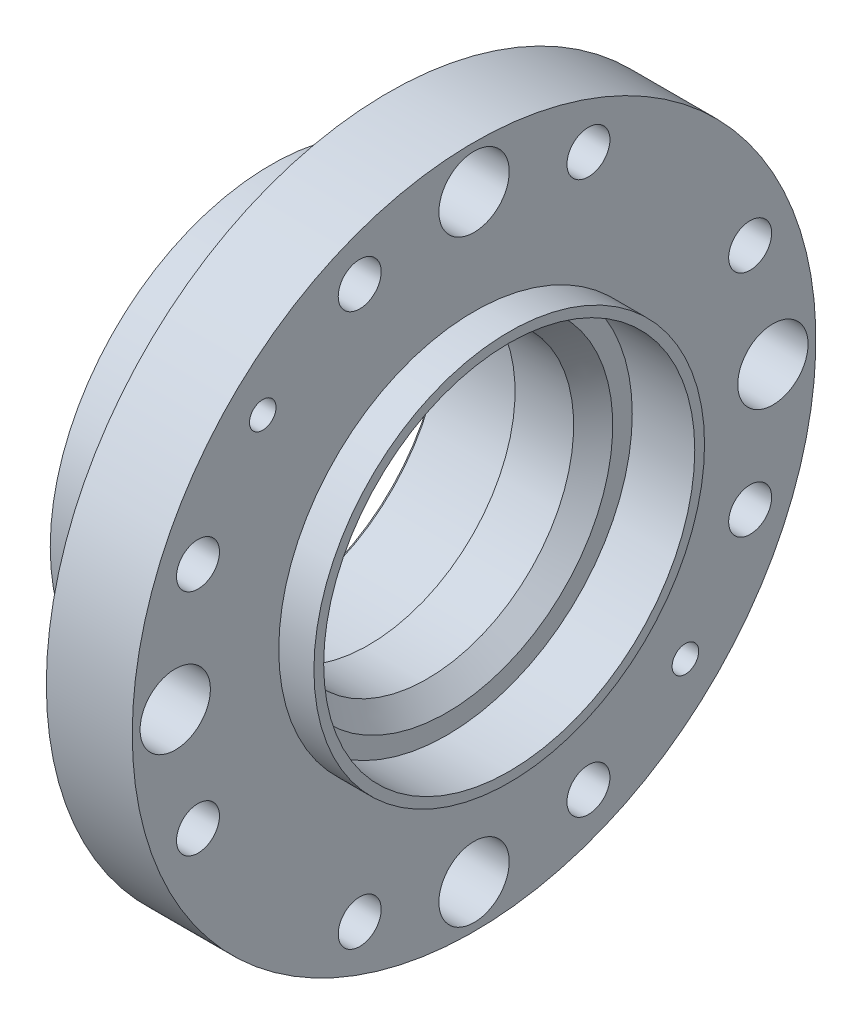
ISO-10303-21;
HEADER;
FILE_DESCRIPTION(('STEP AP214'),'2;1');
FILE_NAME('part.step','',(''),(''),'','','');
FILE_SCHEMA(('AUTOMOTIVE_DESIGN { 1 0 10303 214 1 1 1 1 }'));
ENDSEC;
DATA;
#1=APPLICATION_CONTEXT('core data for automotive mechanical design processes');
#2=APPLICATION_PROTOCOL_DEFINITION('international standard','automotive_design',2000,#1);
#3=PRODUCT_CONTEXT('',#1,'mechanical');
#4=PRODUCT('Part','Part','',(#3));
#5=PRODUCT_RELATED_PRODUCT_CATEGORY('part','',(#4));
#6=PRODUCT_DEFINITION_FORMATION('','',#4);
#7=PRODUCT_DEFINITION_CONTEXT('part definition',#1,'design');
#8=PRODUCT_DEFINITION('design','',#6,#7);
#9=PRODUCT_DEFINITION_SHAPE('','',#8);
#10=(LENGTH_UNIT() NAMED_UNIT(*) SI_UNIT(.MILLI.,.METRE.));
#11=(NAMED_UNIT(*) PLANE_ANGLE_UNIT() SI_UNIT($,.RADIAN.));
#12=(NAMED_UNIT(*) SI_UNIT($,.STERADIAN.) SOLID_ANGLE_UNIT());
#13=UNCERTAINTY_MEASURE_WITH_UNIT(LENGTH_MEASURE(1.E-05),#10,'distance_accuracy_value','');
#14=(GEOMETRIC_REPRESENTATION_CONTEXT(3) GLOBAL_UNCERTAINTY_ASSIGNED_CONTEXT((#13)) GLOBAL_UNIT_ASSIGNED_CONTEXT((#10,
#11,#12)) REPRESENTATION_CONTEXT('',''));
#15=CARTESIAN_POINT('',(0.,0.,0.));
#16=DIRECTION('',(0.,0.,1.));
#17=DIRECTION('',(1.,0.,0.));
#18=AXIS2_PLACEMENT_3D('',#15,#16,#17);
#19=CARTESIAN_POINT('',(22.0003945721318,0.,0.));
#20=DIRECTION('',(-1.,0.,0.));
#21=DIRECTION('',(0.,0.,1.));
#22=AXIS2_PLACEMENT_3D('',#19,#20,#21);
#23=TOROIDAL_SURFACE('',#22,64.5001456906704,8.00000000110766);
#24=CARTESIAN_POINT('',(30.0003945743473,0.,0.));
#25=DIRECTION('',(-1.,0.,0.));
#26=DIRECTION('',(0.,0.,1.));
#27=AXIS2_PLACEMENT_3D('',#24,#25,#26);
#28=CIRCLE('',#27,64.5001456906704);
#29=CARTESIAN_POINT('',(30.0003945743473,0.,64.5001456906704));
#30=VERTEX_POINT('',#29);
#31=EDGE_CURVE('E223',#30,#30,#28,.T.);
#32=ORIENTED_EDGE('',*,*,#31,.T.);
#33=EDGE_LOOP('',(#32));
#34=FACE_BOUND('',#33,.T.);
#35=CARTESIAN_POINT('',(22.0003945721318,0.,0.));
#36=DIRECTION('',(-1.,0.,0.));
#37=DIRECTION('',(0.,0.,1.));
#38=AXIS2_PLACEMENT_3D('',#35,#36,#37);
#39=CIRCLE('',#38,56.5001456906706);
#40=CARTESIAN_POINT('',(22.0003945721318,0.,56.5001456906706));
#41=VERTEX_POINT('',#40);
#42=EDGE_CURVE('E256',#41,#41,#39,.T.);
#43=ORIENTED_EDGE('',*,*,#42,.F.);
#44=EDGE_LOOP('',(#43));
#45=FACE_BOUND('',#44,.T.);
#46=ADVANCED_FACE('F37',(#34,#45),#23,.F.);
#47=CARTESIAN_POINT('',(0.,0.,0.));
#48=DIRECTION('',(-1.,0.,0.));
#49=DIRECTION('',(0.,0.,1.));
#50=AXIS2_PLACEMENT_3D('',#47,#48,#49);
#51=CYLINDRICAL_SURFACE('',#50,56.5001456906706);
#52=CARTESIAN_POINT('',(0.000200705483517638,0.,0.));
#53=DIRECTION('',(-1.,0.,0.));
#54=DIRECTION('',(0.,0.,1.));
#55=AXIS2_PLACEMENT_3D('',#52,#53,#54);
#56=CIRCLE('',#55,56.5001456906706);
#57=CARTESIAN_POINT('',(0.000200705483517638,0.,56.5001456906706));
#58=VERTEX_POINT('',#57);
#59=EDGE_CURVE('E253',#58,#58,#56,.T.);
#60=ORIENTED_EDGE('',*,*,#59,.F.);
#61=EDGE_LOOP('',(#60));
#62=FACE_BOUND('',#61,.T.);
#63=ORIENTED_EDGE('',*,*,#42,.T.);
#64=EDGE_LOOP('',(#63));
#65=FACE_BOUND('',#64,.T.);
#66=ADVANCED_FACE('F284',(#62,#65),#51,.T.);
#67=CARTESIAN_POINT('',(0.000200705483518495,-0.163366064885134,0.));
#68=DIRECTION('',(1.,0.,0.));
#69=DIRECTION('',(0.,0.,-1.));
#70=AXIS2_PLACEMENT_3D('',#67,#68,#69);
#71=PLANE('',#70);
#72=CARTESIAN_POINT('',(0.000200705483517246,34.294678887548,34.2946788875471));
#73=DIRECTION('',(-1.,0.,0.));
#74=DIRECTION('',(0.,0.,1.));
#75=AXIS2_PLACEMENT_3D('',#72,#73,#74);
#76=CIRCLE('',#75,2.49999999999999);
#77=CARTESIAN_POINT('',(0.000200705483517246,34.294678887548,36.7946788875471));
#78=VERTEX_POINT('',#77);
#79=EDGE_CURVE('E81',#78,#78,#76,.T.);
#80=ORIENTED_EDGE('',*,*,#79,.F.);
#81=EDGE_LOOP('',(#80));
#82=FACE_BOUND('',#81,.T.);
#83=CARTESIAN_POINT('',(0.000200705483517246,5.08010534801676E-13,48.5));
#84=DIRECTION('',(-1.,0.,0.));
#85=DIRECTION('',(0.,0.,1.));
#86=AXIS2_PLACEMENT_3D('',#83,#84,#85);
#87=CIRCLE('',#86,2.49999999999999);
#88=CARTESIAN_POINT('',(0.000200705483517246,5.08010534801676E-13,51.));
#89=VERTEX_POINT('',#88);
#90=EDGE_CURVE('E80',#89,#89,#87,.T.);
#91=ORIENTED_EDGE('',*,*,#90,.F.);
#92=EDGE_LOOP('',(#91));
#93=FACE_BOUND('',#92,.T.);
#94=CARTESIAN_POINT('',(0.000200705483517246,-34.2946788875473,34.2946788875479));
#95=DIRECTION('',(-1.,0.,0.));
#96=DIRECTION('',(0.,0.,1.));
#97=AXIS2_PLACEMENT_3D('',#94,#95,#96);
#98=CIRCLE('',#97,2.49999999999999);
#99=CARTESIAN_POINT('',(0.000200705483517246,-34.2946788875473,36.7946788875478));
#100=VERTEX_POINT('',#99);
#101=EDGE_CURVE('E91',#100,#100,#98,.T.);
#102=ORIENTED_EDGE('',*,*,#101,.F.);
#103=EDGE_LOOP('',(#102));
#104=FACE_BOUND('',#103,.T.);
#105=CARTESIAN_POINT('',(0.000200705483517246,-48.5,3.38673689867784E-13));
#106=DIRECTION('',(-1.,0.,0.));
#107=DIRECTION('',(0.,0.,1.));
#108=AXIS2_PLACEMENT_3D('',#105,#106,#107);
#109=CIRCLE('',#108,2.49999999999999);
#110=CARTESIAN_POINT('',(0.000200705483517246,-48.5,2.50000000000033));
#111=VERTEX_POINT('',#110);
#112=EDGE_CURVE('E97',#111,#111,#109,.T.);
#113=ORIENTED_EDGE('',*,*,#112,.F.);
#114=EDGE_LOOP('',(#113));
#115=FACE_BOUND('',#114,.T.);
#116=CARTESIAN_POINT('',(0.000200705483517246,-34.2946788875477,-34.2946788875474));
#117=DIRECTION('',(-1.,0.,0.));
#118=DIRECTION('',(0.,0.,1.));
#119=AXIS2_PLACEMENT_3D('',#116,#117,#118);
#120=CIRCLE('',#119,2.49999999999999);
#121=CARTESIAN_POINT('',(0.000200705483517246,-34.2946788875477,-31.7946788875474));
#122=VERTEX_POINT('',#121);
#123=EDGE_CURVE('E103',#122,#122,#120,.T.);
#124=ORIENTED_EDGE('',*,*,#123,.F.);
#125=EDGE_LOOP('',(#124));
#126=FACE_BOUND('',#125,.T.);
#127=CARTESIAN_POINT('',(0.000200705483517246,-1.69336844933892E-13,-48.5));
#128=DIRECTION('',(-1.,0.,0.));
#129=DIRECTION('',(0.,0.,1.));
#130=AXIS2_PLACEMENT_3D('',#127,#128,#129);
#131=CIRCLE('',#130,2.49999999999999);
#132=CARTESIAN_POINT('',(0.000200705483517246,-1.69336844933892E-13,-46.));
#133=VERTEX_POINT('',#132);
#134=EDGE_CURVE('E109',#133,#133,#131,.T.);
#135=ORIENTED_EDGE('',*,*,#134,.F.);
#136=EDGE_LOOP('',(#135));
#137=FACE_BOUND('',#136,.T.);
#138=CARTESIAN_POINT('',(0.000200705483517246,34.2946788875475,-34.2946788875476));
#139=DIRECTION('',(-1.,0.,0.));
#140=DIRECTION('',(0.,0.,1.));
#141=AXIS2_PLACEMENT_3D('',#138,#139,#140);
#142=CIRCLE('',#141,2.49999999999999);
#143=CARTESIAN_POINT('',(0.000200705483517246,34.2946788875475,-31.7946788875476));
#144=VERTEX_POINT('',#143);
#145=EDGE_CURVE('E115',#144,#144,#142,.T.);
#146=ORIENTED_EDGE('',*,*,#145,.F.);
#147=EDGE_LOOP('',(#146));
#148=FACE_BOUND('',#147,.T.);
#149=CARTESIAN_POINT('',(0.000200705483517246,48.5,0.));
#150=DIRECTION('',(-1.,0.,0.));
#151=DIRECTION('',(0.,0.,1.));
#152=AXIS2_PLACEMENT_3D('',#149,#150,#151);
#153=CIRCLE('',#152,2.49999999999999);
#154=CARTESIAN_POINT('',(0.000200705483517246,48.5,2.49999999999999));
#155=VERTEX_POINT('',#154);
#156=EDGE_CURVE('E121',#155,#155,#153,.T.);
#157=ORIENTED_EDGE('',*,*,#156,.F.);
#158=EDGE_LOOP('',(#157));
#159=FACE_BOUND('',#158,.T.);
#160=CARTESIAN_POINT('',(0.000200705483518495,0.,0.));
#161=DIRECTION('',(1.,0.,0.));
#162=DIRECTION('',(0.,0.,-1.));
#163=AXIS2_PLACEMENT_3D('',#160,#161,#162);
#164=CIRCLE('',#163,43.4994492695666);
#165=CARTESIAN_POINT('',(0.000200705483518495,0.,-43.4994492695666));
#166=VERTEX_POINT('',#165);
#167=EDGE_CURVE('E11',#166,#166,#164,.T.);
#168=ORIENTED_EDGE('',*,*,#167,.T.);
#169=EDGE_LOOP('',(#168));
#170=FACE_BOUND('',#169,.T.);
#171=ORIENTED_EDGE('',*,*,#59,.T.);
#172=EDGE_LOOP('',(#171));
#173=FACE_BOUND('',#172,.T.);
#174=ADVANCED_FACE('F290',(#82,#93,#104,#115,#126,#137,#148,#159,#170,#173),#71,.F.);
#175=CARTESIAN_POINT('',(0.,0.,0.));
#176=DIRECTION('',(-1.,0.,0.));
#177=DIRECTION('',(0.,0.,1.));
#178=AXIS2_PLACEMENT_3D('',#175,#176,#177);
#179=CYLINDRICAL_SURFACE('',#178,42.4994492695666);
#180=CARTESIAN_POINT('',(1.00020070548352,0.,0.));
#181=DIRECTION('',(1.,0.,0.));
#182=DIRECTION('',(0.,0.,-1.));
#183=AXIS2_PLACEMENT_3D('',#180,#181,#182);
#184=CIRCLE('',#183,42.4994492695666);
#185=CARTESIAN_POINT('',(1.00020070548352,0.,-42.4994492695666));
#186=VERTEX_POINT('',#185);
#187=EDGE_CURVE('E45',#186,#186,#184,.F.);
#188=ORIENTED_EDGE('',*,*,#187,.T.);
#189=EDGE_LOOP('',(#188));
#190=FACE_BOUND('',#189,.T.);
#191=CARTESIAN_POINT('',(24.0002007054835,0.,0.));
#192=DIRECTION('',(1.,0.,0.));
#193=DIRECTION('',(0.,0.,-1.));
#194=AXIS2_PLACEMENT_3D('',#191,#192,#193);
#195=CIRCLE('',#194,42.4994492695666);
#196=CARTESIAN_POINT('',(24.0002007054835,0.,-42.4994492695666));
#197=VERTEX_POINT('',#196);
#198=EDGE_CURVE('E262',#197,#197,#195,.T.);
#199=ORIENTED_EDGE('',*,*,#198,.T.);
#200=EDGE_LOOP('',(#199));
#201=FACE_BOUND('',#200,.T.);
#202=ADVANCED_FACE('F267',(#190,#201),#179,.F.);
#203=CARTESIAN_POINT('',(25.0002007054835,-0.16336606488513,0.));
#204=DIRECTION('',(1.,0.,0.));
#205=DIRECTION('',(0.,0.,-1.));
#206=AXIS2_PLACEMENT_3D('',#203,#204,#205);
#207=PLANE('',#206);
#208=CARTESIAN_POINT('',(25.0002007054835,0.,0.));
#209=DIRECTION('',(1.,0.,0.));
#210=DIRECTION('',(0.,0.,-1.));
#211=AXIS2_PLACEMENT_3D('',#208,#209,#210);
#212=CIRCLE('',#211,41.4994492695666);
#213=CARTESIAN_POINT('',(25.0002007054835,0.,-41.4994492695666));
#214=VERTEX_POINT('',#213);
#215=EDGE_CURVE('E259',#214,#214,#212,.F.);
#216=ORIENTED_EDGE('',*,*,#215,.T.);
#217=EDGE_LOOP('',(#216));
#218=FACE_BOUND('',#217,.T.);
#219=CARTESIAN_POINT('',(25.0002007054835,0.,0.));
#220=DIRECTION('',(-1.,0.,0.));
#221=DIRECTION('',(0.,0.,1.));
#222=AXIS2_PLACEMENT_3D('',#219,#220,#221);
#223=CIRCLE('',#222,37.4988875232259);
#224=CARTESIAN_POINT('',(25.0002007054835,0.,37.4988875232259));
#225=VERTEX_POINT('',#224);
#226=EDGE_CURVE('E250',#225,#225,#223,.T.);
#227=ORIENTED_EDGE('',*,*,#226,.F.);
#228=EDGE_LOOP('',(#227));
#229=FACE_BOUND('',#228,.T.);
#230=ADVANCED_FACE('F300',(#218,#229),#207,.F.);
#231=CARTESIAN_POINT('',(0.,0.,0.));
#232=DIRECTION('',(-1.,0.,0.));
#233=DIRECTION('',(0.,0.,1.));
#234=AXIS2_PLACEMENT_3D('',#231,#232,#233);
#235=CYLINDRICAL_SURFACE('',#234,37.4988875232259);
#236=CARTESIAN_POINT('',(40.0002007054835,0.,0.));
#237=DIRECTION('',(-1.,0.,0.));
#238=DIRECTION('',(0.,0.,1.));
#239=AXIS2_PLACEMENT_3D('',#236,#237,#238);
#240=CIRCLE('',#239,37.4988875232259);
#241=CARTESIAN_POINT('',(40.0002007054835,0.,37.4988875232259));
#242=VERTEX_POINT('',#241);
#243=EDGE_CURVE('E247',#242,#242,#240,.T.);
#244=ORIENTED_EDGE('',*,*,#243,.F.);
#245=EDGE_LOOP('',(#244));
#246=FACE_BOUND('',#245,.T.);
#247=ORIENTED_EDGE('',*,*,#226,.T.);
#248=EDGE_LOOP('',(#247));
#249=FACE_BOUND('',#248,.T.);
#250=ADVANCED_FACE('F303',(#246,#249),#235,.F.);
#251=CARTESIAN_POINT('',(40.0002007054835,0.,0.));
#252=DIRECTION('',(1.,0.,0.));
#253=DIRECTION('',(0.,0.,-1.));
#254=AXIS2_PLACEMENT_3D('',#251,#252,#253);
#255=CONICAL_SURFACE('',#254,37.4988875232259,0.785398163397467);
#256=CARTESIAN_POINT('',(45.0002007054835,0.,0.));
#257=DIRECTION('',(-1.,0.,0.));
#258=DIRECTION('',(0.,0.,1.));
#259=AXIS2_PLACEMENT_3D('',#256,#257,#258);
#260=CIRCLE('',#259,42.4988875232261);
#261=CARTESIAN_POINT('',(45.0002007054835,0.,42.4988875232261));
#262=VERTEX_POINT('',#261);
#263=EDGE_CURVE('E244',#262,#262,#260,.T.);
#264=ORIENTED_EDGE('',*,*,#263,.F.);
#265=EDGE_LOOP('',(#264));
#266=FACE_BOUND('',#265,.T.);
#267=ORIENTED_EDGE('',*,*,#243,.T.);
#268=EDGE_LOOP('',(#267));
#269=FACE_BOUND('',#268,.T.);
#270=ADVANCED_FACE('F307',(#266,#269),#255,.F.);
#271=CARTESIAN_POINT('',(45.0002007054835,-0.16336606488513,0.));
#272=DIRECTION('',(-1.,0.,0.));
#273=DIRECTION('',(0.,0.,1.));
#274=AXIS2_PLACEMENT_3D('',#271,#272,#273);
#275=PLANE('',#274);
#276=CARTESIAN_POINT('',(45.0002007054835,0.,0.));
#277=DIRECTION('',(-1.,0.,0.));
#278=DIRECTION('',(0.,0.,1.));
#279=AXIS2_PLACEMENT_3D('',#276,#277,#278);
#280=CIRCLE('',#279,47.4988875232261);
#281=CARTESIAN_POINT('',(45.0002007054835,0.,47.4988875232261));
#282=VERTEX_POINT('',#281);
#283=EDGE_CURVE('E241',#282,#282,#280,.T.);
#284=ORIENTED_EDGE('',*,*,#283,.F.);
#285=EDGE_LOOP('',(#284));
#286=FACE_BOUND('',#285,.T.);
#287=ORIENTED_EDGE('',*,*,#263,.T.);
#288=EDGE_LOOP('',(#287));
#289=FACE_BOUND('',#288,.T.);
#290=ADVANCED_FACE('F311',(#286,#289),#275,.F.);
#291=CARTESIAN_POINT('',(0.,0.,0.));
#292=DIRECTION('',(-1.,0.,0.));
#293=DIRECTION('',(0.,0.,1.));
#294=AXIS2_PLACEMENT_3D('',#291,#292,#293);
#295=CYLINDRICAL_SURFACE('',#294,47.4988875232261);
#296=CARTESIAN_POINT('',(60.999813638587,0.,0.));
#297=DIRECTION('',(-1.,0.,0.));
#298=DIRECTION('',(0.,0.,1.));
#299=AXIS2_PLACEMENT_3D('',#296,#297,#298);
#300=CIRCLE('',#299,47.4988875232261);
#301=CARTESIAN_POINT('',(60.999813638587,0.,47.4988875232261));
#302=VERTEX_POINT('',#301);
#303=EDGE_CURVE('E238',#302,#302,#300,.T.);
#304=ORIENTED_EDGE('',*,*,#303,.F.);
#305=EDGE_LOOP('',(#304));
#306=FACE_BOUND('',#305,.T.);
#307=ORIENTED_EDGE('',*,*,#283,.T.);
#308=EDGE_LOOP('',(#307));
#309=FACE_BOUND('',#308,.T.);
#310=ADVANCED_FACE('F315',(#306,#309),#295,.F.);
#311=CARTESIAN_POINT('',(60.999813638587,-0.16336606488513,0.));
#312=DIRECTION('',(-1.,0.,0.));
#313=DIRECTION('',(0.,0.,1.));
#314=AXIS2_PLACEMENT_3D('',#311,#312,#313);
#315=PLANE('',#314);
#316=CARTESIAN_POINT('',(60.999813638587,0.,0.));
#317=DIRECTION('',(-1.,0.,0.));
#318=DIRECTION('',(0.,0.,1.));
#319=AXIS2_PLACEMENT_3D('',#316,#317,#318);
#320=CIRCLE('',#319,49.9998716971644);
#321=CARTESIAN_POINT('',(60.999813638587,0.,49.9998716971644));
#322=VERTEX_POINT('',#321);
#323=EDGE_CURVE('E235',#322,#322,#320,.T.);
#324=ORIENTED_EDGE('',*,*,#323,.F.);
#325=EDGE_LOOP('',(#324));
#326=FACE_BOUND('',#325,.T.);
#327=ORIENTED_EDGE('',*,*,#303,.T.);
#328=EDGE_LOOP('',(#327));
#329=FACE_BOUND('',#328,.T.);
#330=ADVANCED_FACE('F319',(#326,#329),#315,.F.);
#331=CARTESIAN_POINT('',(0.,0.,0.));
#332=DIRECTION('',(-1.,0.,0.));
#333=DIRECTION('',(0.,0.,1.));
#334=AXIS2_PLACEMENT_3D('',#331,#332,#333);
#335=CYLINDRICAL_SURFACE('',#334,49.9998716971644);
#336=CARTESIAN_POINT('',(51.999813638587,0.,0.));
#337=DIRECTION('',(-1.,0.,0.));
#338=DIRECTION('',(0.,0.,1.));
#339=AXIS2_PLACEMENT_3D('',#336,#337,#338);
#340=CIRCLE('',#339,49.9998716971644);
#341=CARTESIAN_POINT('',(51.999813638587,0.,49.9998716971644));
#342=VERTEX_POINT('',#341);
#343=EDGE_CURVE('E232',#342,#342,#340,.T.);
#344=ORIENTED_EDGE('',*,*,#343,.F.);
#345=EDGE_LOOP('',(#344));
#346=FACE_BOUND('',#345,.T.);
#347=ORIENTED_EDGE('',*,*,#323,.T.);
#348=EDGE_LOOP('',(#347));
#349=FACE_BOUND('',#348,.T.);
#350=ADVANCED_FACE('F323',(#346,#349),#335,.T.);
#351=CARTESIAN_POINT('',(51.999813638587,-0.163366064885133,0.));
#352=DIRECTION('',(1.,0.,0.));
#353=DIRECTION('',(0.,0.,-1.));
#354=AXIS2_PLACEMENT_3D('',#351,#352,#353);
#355=PLANE('',#354);
#356=CARTESIAN_POINT('',(51.999813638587,-54.0936687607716,-54.0936687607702));
#357=DIRECTION('',(1.,0.,0.));
#358=DIRECTION('',(0.,0.,-1.));
#359=AXIS2_PLACEMENT_3D('',#356,#357,#358);
#360=CIRCLE('',#359,3.39999999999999);
#361=CARTESIAN_POINT('',(51.999813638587,-54.0936687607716,-57.4936687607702));
#362=VERTEX_POINT('',#361);
#363=EDGE_CURVE('E130',#362,#362,#360,.T.);
#364=ORIENTED_EDGE('',*,*,#363,.F.);
#365=EDGE_LOOP('',(#364));
#366=FACE_BOUND('',#365,.T.);
#367=CARTESIAN_POINT('',(51.999813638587,54.0936687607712,54.0936687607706));
#368=DIRECTION('',(1.,0.,0.));
#369=DIRECTION('',(0.,0.,-1.));
#370=AXIS2_PLACEMENT_3D('',#367,#368,#369);
#371=CIRCLE('',#370,3.39999999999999);
#372=CARTESIAN_POINT('',(51.999813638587,54.0936687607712,50.6936687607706));
#373=VERTEX_POINT('',#372);
#374=EDGE_CURVE('E142',#373,#373,#371,.T.);
#375=ORIENTED_EDGE('',*,*,#374,.F.);
#376=EDGE_LOOP('',(#375));
#377=FACE_BOUND('',#376,.T.);
#378=CARTESIAN_POINT('',(51.999813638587,8.01295431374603E-13,-76.5));
#379=DIRECTION('',(1.,0.,0.));
#380=DIRECTION('',(0.,0.,-1.));
#381=AXIS2_PLACEMENT_3D('',#378,#379,#380);
#382=CIRCLE('',#381,9.);
#383=CARTESIAN_POINT('',(51.999813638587,8.01295431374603E-13,-85.5));
#384=VERTEX_POINT('',#383);
#385=EDGE_CURVE('E154',#384,#384,#382,.T.);
#386=ORIENTED_EDGE('',*,*,#385,.F.);
#387=EDGE_LOOP('',(#386));
#388=FACE_BOUND('',#387,.T.);
#389=CARTESIAN_POINT('',(51.999813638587,-76.5,-5.34196954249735E-13));
#390=DIRECTION('',(1.,0.,0.));
#391=DIRECTION('',(0.,0.,-1.));
#392=AXIS2_PLACEMENT_3D('',#389,#390,#391);
#393=CIRCLE('',#392,9.);
#394=CARTESIAN_POINT('',(51.999813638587,-76.5,-9.00000000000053));
#395=VERTEX_POINT('',#394);
#396=EDGE_CURVE('E160',#395,#395,#393,.T.);
#397=ORIENTED_EDGE('',*,*,#396,.F.);
#398=EDGE_LOOP('',(#397));
#399=FACE_BOUND('',#398,.T.);
#400=CARTESIAN_POINT('',(51.999813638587,-2.67098477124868E-13,76.5));
#401=DIRECTION('',(1.,0.,0.));
#402=DIRECTION('',(0.,0.,-1.));
#403=AXIS2_PLACEMENT_3D('',#400,#401,#402);
#404=CIRCLE('',#403,9.);
#405=CARTESIAN_POINT('',(51.999813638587,-2.67098477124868E-13,67.5));
#406=VERTEX_POINT('',#405);
#407=EDGE_CURVE('E166',#406,#406,#404,.T.);
#408=ORIENTED_EDGE('',*,*,#407,.F.);
#409=EDGE_LOOP('',(#408));
#410=FACE_BOUND('',#409,.T.);
#411=CARTESIAN_POINT('',(51.999813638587,76.5,0.));
#412=DIRECTION('',(1.,0.,0.));
#413=DIRECTION('',(0.,0.,-1.));
#414=AXIS2_PLACEMENT_3D('',#411,#412,#413);
#415=CIRCLE('',#414,9.);
#416=CARTESIAN_POINT('',(51.999813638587,76.5,-9.));
#417=VERTEX_POINT('',#416);
#418=EDGE_CURVE('E172',#417,#417,#415,.T.);
#419=ORIENTED_EDGE('',*,*,#418,.F.);
#420=EDGE_LOOP('',(#419));
#421=FACE_BOUND('',#420,.T.);
#422=CARTESIAN_POINT('',(51.999813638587,-29.275575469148,70.6774913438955));
#423=DIRECTION('',(1.,0.,0.));
#424=DIRECTION('',(0.,0.,-1.));
#425=AXIS2_PLACEMENT_3D('',#422,#423,#424);
#426=CIRCLE('',#425,5.49999999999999);
#427=CARTESIAN_POINT('',(51.999813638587,-29.275575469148,65.1774913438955));
#428=VERTEX_POINT('',#427);
#429=EDGE_CURVE('E178',#428,#428,#426,.T.);
#430=ORIENTED_EDGE('',*,*,#429,.F.);
#431=EDGE_LOOP('',(#430));
#432=FACE_BOUND('',#431,.T.);
#433=CARTESIAN_POINT('',(51.999813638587,29.2752825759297,70.6767842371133));
#434=DIRECTION('',(1.,0.,0.));
#435=DIRECTION('',(0.,0.,-1.));
#436=AXIS2_PLACEMENT_3D('',#433,#434,#435);
#437=CIRCLE('',#436,5.5);
#438=CARTESIAN_POINT('',(51.999813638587,29.2752825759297,65.1767842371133));
#439=VERTEX_POINT('',#438);
#440=EDGE_CURVE('E184',#439,#439,#437,.T.);
#441=ORIENTED_EDGE('',*,*,#440,.F.);
#442=EDGE_LOOP('',(#441));
#443=FACE_BOUND('',#442,.T.);
#444=CARTESIAN_POINT('',(51.999813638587,-70.6774913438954,-29.2755754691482));
#445=DIRECTION('',(1.,0.,0.));
#446=DIRECTION('',(0.,0.,-1.));
#447=AXIS2_PLACEMENT_3D('',#444,#445,#446);
#448=CIRCLE('',#447,5.49999999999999);
#449=CARTESIAN_POINT('',(51.999813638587,-70.6774913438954,-34.7755754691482));
#450=VERTEX_POINT('',#449);
#451=EDGE_CURVE('E190',#450,#450,#448,.T.);
#452=ORIENTED_EDGE('',*,*,#451,.F.);
#453=EDGE_LOOP('',(#452));
#454=FACE_BOUND('',#453,.T.);
#455=CARTESIAN_POINT('',(51.999813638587,-70.6767842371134,29.2752825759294));
#456=DIRECTION('',(1.,0.,0.));
#457=DIRECTION('',(0.,0.,-1.));
#458=AXIS2_PLACEMENT_3D('',#455,#456,#457);
#459=CIRCLE('',#458,5.5);
#460=CARTESIAN_POINT('',(51.999813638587,-70.6767842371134,23.7752825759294));
#461=VERTEX_POINT('',#460);
#462=EDGE_CURVE('E196',#461,#461,#459,.T.);
#463=ORIENTED_EDGE('',*,*,#462,.F.);
#464=EDGE_LOOP('',(#463));
#465=FACE_BOUND('',#464,.T.);
#466=CARTESIAN_POINT('',(51.999813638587,29.2755754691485,-70.6774913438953));
#467=DIRECTION('',(1.,0.,0.));
#468=DIRECTION('',(0.,0.,-1.));
#469=AXIS2_PLACEMENT_3D('',#466,#467,#468);
#470=CIRCLE('',#469,5.49999999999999);
#471=CARTESIAN_POINT('',(51.999813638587,29.2755754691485,-76.1774913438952));
#472=VERTEX_POINT('',#471);
#473=EDGE_CURVE('E202',#472,#472,#470,.T.);
#474=ORIENTED_EDGE('',*,*,#473,.F.);
#475=EDGE_LOOP('',(#474));
#476=FACE_BOUND('',#475,.T.);
#477=CARTESIAN_POINT('',(51.999813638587,-29.2752825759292,-70.6767842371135));
#478=DIRECTION('',(1.,0.,0.));
#479=DIRECTION('',(0.,0.,-1.));
#480=AXIS2_PLACEMENT_3D('',#477,#478,#479);
#481=CIRCLE('',#480,5.5);
#482=CARTESIAN_POINT('',(51.999813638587,-29.2752825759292,-76.1767842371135));
#483=VERTEX_POINT('',#482);
#484=EDGE_CURVE('E208',#483,#483,#481,.T.);
#485=ORIENTED_EDGE('',*,*,#484,.F.);
#486=EDGE_LOOP('',(#485));
#487=FACE_BOUND('',#486,.T.);
#488=CARTESIAN_POINT('',(51.999813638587,70.6774913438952,29.2755754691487));
#489=DIRECTION('',(1.,0.,0.));
#490=DIRECTION('',(0.,0.,-1.));
#491=AXIS2_PLACEMENT_3D('',#488,#489,#490);
#492=CIRCLE('',#491,5.49999999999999);
#493=CARTESIAN_POINT('',(51.999813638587,70.6774913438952,23.7755754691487));
#494=VERTEX_POINT('',#493);
#495=EDGE_CURVE('E214',#494,#494,#492,.T.);
#496=ORIENTED_EDGE('',*,*,#495,.F.);
#497=EDGE_LOOP('',(#496));
#498=FACE_BOUND('',#497,.T.);
#499=CARTESIAN_POINT('',(51.999813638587,70.6767842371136,-29.2752825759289));
#500=DIRECTION('',(1.,0.,0.));
#501=DIRECTION('',(0.,0.,-1.));
#502=AXIS2_PLACEMENT_3D('',#499,#500,#501);
#503=CIRCLE('',#502,5.5);
#504=CARTESIAN_POINT('',(51.999813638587,70.6767842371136,-34.7752825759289));
#505=VERTEX_POINT('',#504);
#506=EDGE_CURVE('E220',#505,#505,#503,.T.);
#507=ORIENTED_EDGE('',*,*,#506,.F.);
#508=EDGE_LOOP('',(#507));
#509=FACE_BOUND('',#508,.T.);
#510=ORIENTED_EDGE('',*,*,#343,.T.);
#511=EDGE_LOOP('',(#510));
#512=FACE_BOUND('',#511,.T.);
#513=CARTESIAN_POINT('',(51.999813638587,0.,0.));
#514=DIRECTION('',(-1.,0.,0.));
#515=DIRECTION('',(0.,0.,1.));
#516=AXIS2_PLACEMENT_3D('',#513,#514,#515);
#517=CIRCLE('',#516,87.4997413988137);
#518=CARTESIAN_POINT('',(51.999813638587,0.,87.4997413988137));
#519=VERTEX_POINT('',#518);
#520=EDGE_CURVE('E229',#519,#519,#517,.T.);
#521=ORIENTED_EDGE('',*,*,#520,.F.);
#522=EDGE_LOOP('',(#521));
#523=FACE_BOUND('',#522,.T.);
#524=ADVANCED_FACE('F327',(#366,#377,#388,#399,#410,#421,#432,#443,#454,#465,#476,#487,#498,
#509,#512,#523),#355,.T.);
#525=CARTESIAN_POINT('',(0.,0.,0.));
#526=DIRECTION('',(-1.,0.,0.));
#527=DIRECTION('',(0.,0.,1.));
#528=AXIS2_PLACEMENT_3D('',#525,#526,#527);
#529=CYLINDRICAL_SURFACE('',#528,87.4997413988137);
#530=CARTESIAN_POINT('',(30.0003945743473,0.,0.));
#531=DIRECTION('',(-1.,0.,0.));
#532=DIRECTION('',(0.,0.,1.));
#533=AXIS2_PLACEMENT_3D('',#530,#531,#532);
#534=CIRCLE('',#533,87.4997413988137);
#535=CARTESIAN_POINT('',(30.0003945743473,0.,87.4997413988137));
#536=VERTEX_POINT('',#535);
#537=EDGE_CURVE('E226',#536,#536,#534,.T.);
#538=ORIENTED_EDGE('',*,*,#537,.F.);
#539=EDGE_LOOP('',(#538));
#540=FACE_BOUND('',#539,.T.);
#541=ORIENTED_EDGE('',*,*,#520,.T.);
#542=EDGE_LOOP('',(#541));
#543=FACE_BOUND('',#542,.T.);
#544=ADVANCED_FACE('F331',(#540,#543),#529,.T.);
#545=CARTESIAN_POINT('',(30.0003945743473,-0.16336606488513,0.));
#546=DIRECTION('',(1.,0.,0.));
#547=DIRECTION('',(0.,0.,-1.));
#548=AXIS2_PLACEMENT_3D('',#545,#546,#547);
#549=PLANE('',#548);
#550=CARTESIAN_POINT('',(30.0003945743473,-54.0936687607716,-54.0936687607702));
#551=DIRECTION('',(-1.,0.,0.));
#552=DIRECTION('',(0.,0.,-1.));
#553=AXIS2_PLACEMENT_3D('',#550,#551,#552);
#554=CIRCLE('',#553,7.5);
#555=CARTESIAN_POINT('',(30.0003945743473,-54.0936687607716,-61.5936687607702));
#556=VERTEX_POINT('',#555);
#557=EDGE_CURVE('E133',#556,#556,#554,.T.);
#558=ORIENTED_EDGE('',*,*,#557,.F.);
#559=EDGE_LOOP('',(#558));
#560=FACE_BOUND('',#559,.T.);
#561=CARTESIAN_POINT('',(30.0003945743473,54.0936687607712,54.0936687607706));
#562=DIRECTION('',(-1.,0.,0.));
#563=DIRECTION('',(0.,0.,1.));
#564=AXIS2_PLACEMENT_3D('',#561,#562,#563);
#565=CIRCLE('',#564,7.5);
#566=CARTESIAN_POINT('',(30.0003945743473,54.0936687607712,61.5936687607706));
#567=VERTEX_POINT('',#566);
#568=EDGE_CURVE('E145',#567,#567,#565,.T.);
#569=ORIENTED_EDGE('',*,*,#568,.F.);
#570=EDGE_LOOP('',(#569));
#571=FACE_BOUND('',#570,.T.);
#572=CARTESIAN_POINT('',(30.0003945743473,8.01295431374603E-13,-76.5));
#573=DIRECTION('',(-1.,0.,0.));
#574=DIRECTION('',(0.,0.,1.));
#575=AXIS2_PLACEMENT_3D('',#572,#573,#574);
#576=CIRCLE('',#575,9.);
#577=CARTESIAN_POINT('',(30.0003945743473,8.01295431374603E-13,-67.5));
#578=VERTEX_POINT('',#577);
#579=EDGE_CURVE('E149',#578,#578,#576,.T.);
#580=ORIENTED_EDGE('',*,*,#579,.F.);
#581=EDGE_LOOP('',(#580));
#582=FACE_BOUND('',#581,.T.);
#583=CARTESIAN_POINT('',(30.0003945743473,-76.5,-5.34196954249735E-13));
#584=DIRECTION('',(-1.,0.,0.));
#585=DIRECTION('',(0.,0.,1.));
#586=AXIS2_PLACEMENT_3D('',#583,#584,#585);
#587=CIRCLE('',#586,9.);
#588=CARTESIAN_POINT('',(30.0003945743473,-76.5,8.99999999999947));
#589=VERTEX_POINT('',#588);
#590=EDGE_CURVE('E157',#589,#589,#587,.T.);
#591=ORIENTED_EDGE('',*,*,#590,.F.);
#592=EDGE_LOOP('',(#591));
#593=FACE_BOUND('',#592,.T.);
#594=CARTESIAN_POINT('',(30.0003945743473,-2.67098477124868E-13,76.5));
#595=DIRECTION('',(-1.,0.,0.));
#596=DIRECTION('',(0.,0.,1.));
#597=AXIS2_PLACEMENT_3D('',#594,#595,#596);
#598=CIRCLE('',#597,9.);
#599=CARTESIAN_POINT('',(30.0003945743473,-2.67098477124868E-13,85.5));
#600=VERTEX_POINT('',#599);
#601=EDGE_CURVE('E163',#600,#600,#598,.T.);
#602=ORIENTED_EDGE('',*,*,#601,.F.);
#603=EDGE_LOOP('',(#602));
#604=FACE_BOUND('',#603,.T.);
#605=CARTESIAN_POINT('',(30.0003945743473,76.5,0.));
#606=DIRECTION('',(-1.,0.,0.));
#607=DIRECTION('',(0.,0.,1.));
#608=AXIS2_PLACEMENT_3D('',#605,#606,#607);
#609=CIRCLE('',#608,9.);
#610=CARTESIAN_POINT('',(30.0003945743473,76.5,9.));
#611=VERTEX_POINT('',#610);
#612=EDGE_CURVE('E169',#611,#611,#609,.T.);
#613=ORIENTED_EDGE('',*,*,#612,.F.);
#614=EDGE_LOOP('',(#613));
#615=FACE_BOUND('',#614,.T.);
#616=CARTESIAN_POINT('',(30.0003945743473,-29.275575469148,70.6774913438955));
#617=DIRECTION('',(-1.,0.,0.));
#618=DIRECTION('',(0.,-1.,0.));
#619=AXIS2_PLACEMENT_3D('',#616,#617,#618);
#620=CIRCLE('',#619,5.49999999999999);
#621=CARTESIAN_POINT('',(30.0003945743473,-34.775575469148,70.6774913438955));
#622=VERTEX_POINT('',#621);
#623=EDGE_CURVE('E175',#622,#622,#620,.T.);
#624=ORIENTED_EDGE('',*,*,#623,.F.);
#625=EDGE_LOOP('',(#624));
#626=FACE_BOUND('',#625,.T.);
#627=CARTESIAN_POINT('',(30.0003945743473,29.2752825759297,70.6767842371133));
#628=DIRECTION('',(-1.,0.,0.));
#629=DIRECTION('',(0.,-1.,0.));
#630=AXIS2_PLACEMENT_3D('',#627,#628,#629);
#631=CIRCLE('',#630,5.5);
#632=CARTESIAN_POINT('',(30.0003945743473,23.7752825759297,70.6767842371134));
#633=VERTEX_POINT('',#632);
#634=EDGE_CURVE('E181',#633,#633,#631,.T.);
#635=ORIENTED_EDGE('',*,*,#634,.F.);
#636=EDGE_LOOP('',(#635));
#637=FACE_BOUND('',#636,.T.);
#638=CARTESIAN_POINT('',(30.0003945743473,-70.6774913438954,-29.2755754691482));
#639=DIRECTION('',(-1.,0.,0.));
#640=DIRECTION('',(0.,0.,-1.));
#641=AXIS2_PLACEMENT_3D('',#638,#639,#640);
#642=CIRCLE('',#641,5.49999999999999);
#643=CARTESIAN_POINT('',(30.0003945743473,-70.6774913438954,-34.7755754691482));
#644=VERTEX_POINT('',#643);
#645=EDGE_CURVE('E187',#644,#644,#642,.T.);
#646=ORIENTED_EDGE('',*,*,#645,.F.);
#647=EDGE_LOOP('',(#646));
#648=FACE_BOUND('',#647,.T.);
#649=CARTESIAN_POINT('',(30.0003945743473,-70.6767842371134,29.2752825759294));
#650=DIRECTION('',(-1.,0.,0.));
#651=DIRECTION('',(0.,0.,-1.));
#652=AXIS2_PLACEMENT_3D('',#649,#650,#651);
#653=CIRCLE('',#652,5.5);
#654=CARTESIAN_POINT('',(30.0003945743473,-70.6767842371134,23.7752825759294));
#655=VERTEX_POINT('',#654);
#656=EDGE_CURVE('E193',#655,#655,#653,.T.);
#657=ORIENTED_EDGE('',*,*,#656,.F.);
#658=EDGE_LOOP('',(#657));
#659=FACE_BOUND('',#658,.T.);
#660=CARTESIAN_POINT('',(30.0003945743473,29.2755754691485,-70.6774913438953));
#661=DIRECTION('',(-1.,0.,0.));
#662=DIRECTION('',(0.,1.,0.));
#663=AXIS2_PLACEMENT_3D('',#660,#661,#662);
#664=CIRCLE('',#663,5.49999999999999);
#665=CARTESIAN_POINT('',(30.0003945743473,34.7755754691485,-70.6774913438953));
#666=VERTEX_POINT('',#665);
#667=EDGE_CURVE('E199',#666,#666,#664,.T.);
#668=ORIENTED_EDGE('',*,*,#667,.F.);
#669=EDGE_LOOP('',(#668));
#670=FACE_BOUND('',#669,.T.);
#671=CARTESIAN_POINT('',(30.0003945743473,-29.2752825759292,-70.6767842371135));
#672=DIRECTION('',(-1.,0.,0.));
#673=DIRECTION('',(0.,1.,0.));
#674=AXIS2_PLACEMENT_3D('',#671,#672,#673);
#675=CIRCLE('',#674,5.5);
#676=CARTESIAN_POINT('',(30.0003945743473,-23.7752825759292,-70.6767842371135));
#677=VERTEX_POINT('',#676);
#678=EDGE_CURVE('E205',#677,#677,#675,.T.);
#679=ORIENTED_EDGE('',*,*,#678,.F.);
#680=EDGE_LOOP('',(#679));
#681=FACE_BOUND('',#680,.T.);
#682=CARTESIAN_POINT('',(30.0003945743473,70.6774913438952,29.2755754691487));
#683=DIRECTION('',(-1.,0.,0.));
#684=DIRECTION('',(0.,0.,1.));
#685=AXIS2_PLACEMENT_3D('',#682,#683,#684);
#686=CIRCLE('',#685,5.49999999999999);
#687=CARTESIAN_POINT('',(30.0003945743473,70.6774913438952,34.7755754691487));
#688=VERTEX_POINT('',#687);
#689=EDGE_CURVE('E211',#688,#688,#686,.T.);
#690=ORIENTED_EDGE('',*,*,#689,.F.);
#691=EDGE_LOOP('',(#690));
#692=FACE_BOUND('',#691,.T.);
#693=CARTESIAN_POINT('',(30.0003945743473,70.6767842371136,-29.2752825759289));
#694=DIRECTION('',(-1.,0.,0.));
#695=DIRECTION('',(0.,0.,1.));
#696=AXIS2_PLACEMENT_3D('',#693,#694,#695);
#697=CIRCLE('',#696,5.5);
#698=CARTESIAN_POINT('',(30.0003945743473,70.6767842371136,-23.7752825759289));
#699=VERTEX_POINT('',#698);
#700=EDGE_CURVE('E217',#699,#699,#697,.T.);
#701=ORIENTED_EDGE('',*,*,#700,.F.);
#702=EDGE_LOOP('',(#701));
#703=FACE_BOUND('',#702,.T.);
#704=ORIENTED_EDGE('',*,*,#31,.F.);
#705=EDGE_LOOP('',(#704));
#706=FACE_BOUND('',#705,.T.);
#707=ORIENTED_EDGE('',*,*,#537,.T.);
#708=EDGE_LOOP('',(#707));
#709=FACE_BOUND('',#708,.T.);
#710=ADVANCED_FACE('F335',(#560,#571,#582,#593,#604,#615,#626,#637,#648,#659,#670,#681,#692,
#703,#706,#709),#549,.F.);
#711=CARTESIAN_POINT('',(58.0003945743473,70.6767842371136,-29.2752825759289));
#712=DIRECTION('',(-1.,0.,0.));
#713=DIRECTION('',(0.,0.,1.));
#714=AXIS2_PLACEMENT_3D('',#711,#712,#713);
#715=CYLINDRICAL_SURFACE('',#714,5.5);
#716=ORIENTED_EDGE('',*,*,#506,.T.);
#717=EDGE_LOOP('',(#716));
#718=FACE_BOUND('',#717,.T.);
#719=ORIENTED_EDGE('',*,*,#700,.T.);
#720=EDGE_LOOP('',(#719));
#721=FACE_BOUND('',#720,.T.);
#722=ADVANCED_FACE('F339',(#718,#721),#715,.F.);
#723=CARTESIAN_POINT('',(58.0003945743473,70.6774913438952,29.2755754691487));
#724=DIRECTION('',(-1.,0.,0.));
#725=DIRECTION('',(0.,0.,1.));
#726=AXIS2_PLACEMENT_3D('',#723,#724,#725);
#727=CYLINDRICAL_SURFACE('',#726,5.49999999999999);
#728=ORIENTED_EDGE('',*,*,#495,.T.);
#729=EDGE_LOOP('',(#728));
#730=FACE_BOUND('',#729,.T.);
#731=ORIENTED_EDGE('',*,*,#689,.T.);
#732=EDGE_LOOP('',(#731));
#733=FACE_BOUND('',#732,.T.);
#734=ADVANCED_FACE('F343',(#730,#733),#727,.F.);
#735=CARTESIAN_POINT('',(58.0003945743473,-29.2752825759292,-70.6767842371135));
#736=DIRECTION('',(-1.,0.,0.));
#737=DIRECTION('',(0.,0.,1.));
#738=AXIS2_PLACEMENT_3D('',#735,#736,#737);
#739=CYLINDRICAL_SURFACE('',#738,5.5);
#740=ORIENTED_EDGE('',*,*,#484,.T.);
#741=EDGE_LOOP('',(#740));
#742=FACE_BOUND('',#741,.T.);
#743=ORIENTED_EDGE('',*,*,#678,.T.);
#744=EDGE_LOOP('',(#743));
#745=FACE_BOUND('',#744,.T.);
#746=ADVANCED_FACE('F347',(#742,#745),#739,.F.);
#747=CARTESIAN_POINT('',(58.0003945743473,29.2755754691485,-70.6774913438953));
#748=DIRECTION('',(-1.,0.,0.));
#749=DIRECTION('',(0.,0.,1.));
#750=AXIS2_PLACEMENT_3D('',#747,#748,#749);
#751=CYLINDRICAL_SURFACE('',#750,5.49999999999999);
#752=ORIENTED_EDGE('',*,*,#473,.T.);
#753=EDGE_LOOP('',(#752));
#754=FACE_BOUND('',#753,.T.);
#755=ORIENTED_EDGE('',*,*,#667,.T.);
#756=EDGE_LOOP('',(#755));
#757=FACE_BOUND('',#756,.T.);
#758=ADVANCED_FACE('F351',(#754,#757),#751,.F.);
#759=CARTESIAN_POINT('',(58.0003945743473,-70.6767842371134,29.2752825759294));
#760=DIRECTION('',(-1.,0.,0.));
#761=DIRECTION('',(0.,0.,1.));
#762=AXIS2_PLACEMENT_3D('',#759,#760,#761);
#763=CYLINDRICAL_SURFACE('',#762,5.5);
#764=ORIENTED_EDGE('',*,*,#462,.T.);
#765=EDGE_LOOP('',(#764));
#766=FACE_BOUND('',#765,.T.);
#767=ORIENTED_EDGE('',*,*,#656,.T.);
#768=EDGE_LOOP('',(#767));
#769=FACE_BOUND('',#768,.T.);
#770=ADVANCED_FACE('F355',(#766,#769),#763,.F.);
#771=CARTESIAN_POINT('',(58.0003945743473,-70.6774913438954,-29.2755754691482));
#772=DIRECTION('',(-1.,0.,0.));
#773=DIRECTION('',(0.,0.,1.));
#774=AXIS2_PLACEMENT_3D('',#771,#772,#773);
#775=CYLINDRICAL_SURFACE('',#774,5.49999999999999);
#776=ORIENTED_EDGE('',*,*,#451,.T.);
#777=EDGE_LOOP('',(#776));
#778=FACE_BOUND('',#777,.T.);
#779=ORIENTED_EDGE('',*,*,#645,.T.);
#780=EDGE_LOOP('',(#779));
#781=FACE_BOUND('',#780,.T.);
#782=ADVANCED_FACE('F359',(#778,#781),#775,.F.);
#783=CARTESIAN_POINT('',(58.0003945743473,29.2752825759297,70.6767842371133));
#784=DIRECTION('',(-1.,0.,0.));
#785=DIRECTION('',(0.,0.,1.));
#786=AXIS2_PLACEMENT_3D('',#783,#784,#785);
#787=CYLINDRICAL_SURFACE('',#786,5.5);
#788=ORIENTED_EDGE('',*,*,#440,.T.);
#789=EDGE_LOOP('',(#788));
#790=FACE_BOUND('',#789,.T.);
#791=ORIENTED_EDGE('',*,*,#634,.T.);
#792=EDGE_LOOP('',(#791));
#793=FACE_BOUND('',#792,.T.);
#794=ADVANCED_FACE('F363',(#790,#793),#787,.F.);
#795=CARTESIAN_POINT('',(58.0003945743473,-29.275575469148,70.6774913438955));
#796=DIRECTION('',(-1.,0.,0.));
#797=DIRECTION('',(0.,0.,1.));
#798=AXIS2_PLACEMENT_3D('',#795,#796,#797);
#799=CYLINDRICAL_SURFACE('',#798,5.49999999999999);
#800=ORIENTED_EDGE('',*,*,#429,.T.);
#801=EDGE_LOOP('',(#800));
#802=FACE_BOUND('',#801,.T.);
#803=ORIENTED_EDGE('',*,*,#623,.T.);
#804=EDGE_LOOP('',(#803));
#805=FACE_BOUND('',#804,.T.);
#806=ADVANCED_FACE('F367',(#802,#805),#799,.F.);
#807=CARTESIAN_POINT('',(58.0003945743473,76.5,0.));
#808=DIRECTION('',(-1.,0.,0.));
#809=DIRECTION('',(0.,0.,1.));
#810=AXIS2_PLACEMENT_3D('',#807,#808,#809);
#811=CYLINDRICAL_SURFACE('',#810,9.);
#812=ORIENTED_EDGE('',*,*,#418,.T.);
#813=EDGE_LOOP('',(#812));
#814=FACE_BOUND('',#813,.T.);
#815=ORIENTED_EDGE('',*,*,#612,.T.);
#816=EDGE_LOOP('',(#815));
#817=FACE_BOUND('',#816,.T.);
#818=ADVANCED_FACE('F371',(#814,#817),#811,.F.);
#819=CARTESIAN_POINT('',(58.0003945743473,-2.67098477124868E-13,76.5));
#820=DIRECTION('',(-1.,0.,0.));
#821=DIRECTION('',(0.,0.,1.));
#822=AXIS2_PLACEMENT_3D('',#819,#820,#821);
#823=CYLINDRICAL_SURFACE('',#822,9.);
#824=ORIENTED_EDGE('',*,*,#407,.T.);
#825=EDGE_LOOP('',(#824));
#826=FACE_BOUND('',#825,.T.);
#827=ORIENTED_EDGE('',*,*,#601,.T.);
#828=EDGE_LOOP('',(#827));
#829=FACE_BOUND('',#828,.T.);
#830=ADVANCED_FACE('F375',(#826,#829),#823,.F.);
#831=CARTESIAN_POINT('',(58.0003945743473,-76.5,-5.34196954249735E-13));
#832=DIRECTION('',(-1.,0.,0.));
#833=DIRECTION('',(0.,0.,1.));
#834=AXIS2_PLACEMENT_3D('',#831,#832,#833);
#835=CYLINDRICAL_SURFACE('',#834,9.);
#836=ORIENTED_EDGE('',*,*,#396,.T.);
#837=EDGE_LOOP('',(#836));
#838=FACE_BOUND('',#837,.T.);
#839=ORIENTED_EDGE('',*,*,#590,.T.);
#840=EDGE_LOOP('',(#839));
#841=FACE_BOUND('',#840,.T.);
#842=ADVANCED_FACE('F379',(#838,#841),#835,.F.);
#843=CARTESIAN_POINT('',(58.0003945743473,8.01295431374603E-13,-76.5));
#844=DIRECTION('',(-1.,0.,0.));
#845=DIRECTION('',(0.,0.,1.));
#846=AXIS2_PLACEMENT_3D('',#843,#844,#845);
#847=CYLINDRICAL_SURFACE('',#846,9.);
#848=ORIENTED_EDGE('',*,*,#385,.T.);
#849=EDGE_LOOP('',(#848));
#850=FACE_BOUND('',#849,.T.);
#851=ORIENTED_EDGE('',*,*,#579,.T.);
#852=EDGE_LOOP('',(#851));
#853=FACE_BOUND('',#852,.T.);
#854=ADVANCED_FACE('F383',(#850,#853),#847,.F.);
#855=CARTESIAN_POINT('',(40.0003945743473,54.0936687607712,54.0936687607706));
#856=DIRECTION('',(-1.,0.,0.));
#857=DIRECTION('',(0.,0.,1.));
#858=AXIS2_PLACEMENT_3D('',#855,#856,#857);
#859=CYLINDRICAL_SURFACE('',#858,7.5);
#860=CARTESIAN_POINT('',(40.0003945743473,54.0936687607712,54.0936687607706));
#861=DIRECTION('',(-1.,0.,0.));
#862=DIRECTION('',(0.,0.,1.));
#863=AXIS2_PLACEMENT_3D('',#860,#861,#862);
#864=CIRCLE('',#863,7.5);
#865=CARTESIAN_POINT('',(40.0003945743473,54.0936687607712,61.5936687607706));
#866=VERTEX_POINT('',#865);
#867=EDGE_CURVE('E146',#866,#866,#864,.T.);
#868=ORIENTED_EDGE('',*,*,#867,.F.);
#869=EDGE_LOOP('',(#868));
#870=FACE_BOUND('',#869,.T.);
#871=ORIENTED_EDGE('',*,*,#568,.T.);
#872=EDGE_LOOP('',(#871));
#873=FACE_BOUND('',#872,.T.);
#874=ADVANCED_FACE('F387',(#870,#873),#859,.F.);
#875=CARTESIAN_POINT('',(40.0003945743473,54.0936687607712,54.0936687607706));
#876=DIRECTION('',(-1.,0.,0.));
#877=DIRECTION('',(0.,0.,1.));
#878=AXIS2_PLACEMENT_3D('',#875,#876,#877);
#879=PLANE('',#878);
#880=CARTESIAN_POINT('',(40.0003945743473,54.0936687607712,54.0936687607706));
#881=DIRECTION('',(-1.,0.,0.));
#882=DIRECTION('',(0.,0.,1.));
#883=AXIS2_PLACEMENT_3D('',#880,#881,#882);
#884=CIRCLE('',#883,3.39999999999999);
#885=CARTESIAN_POINT('',(40.0003945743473,54.0936687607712,57.4936687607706));
#886=VERTEX_POINT('',#885);
#887=EDGE_CURVE('E137',#886,#886,#884,.T.);
#888=ORIENTED_EDGE('',*,*,#887,.F.);
#889=EDGE_LOOP('',(#888));
#890=FACE_BOUND('',#889,.T.);
#891=ORIENTED_EDGE('',*,*,#867,.T.);
#892=EDGE_LOOP('',(#891));
#893=FACE_BOUND('',#892,.T.);
#894=ADVANCED_FACE('F391',(#890,#893),#879,.T.);
#895=CARTESIAN_POINT('',(40.0003945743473,54.0936687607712,54.0936687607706));
#896=DIRECTION('',(-1.,0.,0.));
#897=DIRECTION('',(0.,0.,1.));
#898=AXIS2_PLACEMENT_3D('',#895,#896,#897);
#899=CYLINDRICAL_SURFACE('',#898,3.39999999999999);
#900=ORIENTED_EDGE('',*,*,#374,.T.);
#901=EDGE_LOOP('',(#900));
#902=FACE_BOUND('',#901,.T.);
#903=ORIENTED_EDGE('',*,*,#887,.T.);
#904=EDGE_LOOP('',(#903));
#905=FACE_BOUND('',#904,.T.);
#906=ADVANCED_FACE('F395',(#902,#905),#899,.F.);
#907=CARTESIAN_POINT('',(40.0003945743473,-54.0936687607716,-54.0936687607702));
#908=DIRECTION('',(-1.,0.,0.));
#909=DIRECTION('',(0.,0.,1.));
#910=AXIS2_PLACEMENT_3D('',#907,#908,#909);
#911=CYLINDRICAL_SURFACE('',#910,7.5);
#912=CARTESIAN_POINT('',(40.0003945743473,-54.0936687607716,-54.0936687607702));
#913=DIRECTION('',(-1.,0.,0.));
#914=DIRECTION('',(0.,0.,-1.));
#915=AXIS2_PLACEMENT_3D('',#912,#913,#914);
#916=CIRCLE('',#915,7.5);
#917=CARTESIAN_POINT('',(40.0003945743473,-54.0936687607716,-61.5936687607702));
#918=VERTEX_POINT('',#917);
#919=EDGE_CURVE('E134',#918,#918,#916,.T.);
#920=ORIENTED_EDGE('',*,*,#919,.F.);
#921=EDGE_LOOP('',(#920));
#922=FACE_BOUND('',#921,.T.);
#923=ORIENTED_EDGE('',*,*,#557,.T.);
#924=EDGE_LOOP('',(#923));
#925=FACE_BOUND('',#924,.T.);
#926=ADVANCED_FACE('F399',(#922,#925),#911,.F.);
#927=CARTESIAN_POINT('',(40.0003945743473,-54.0936687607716,-54.0936687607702));
#928=DIRECTION('',(-1.,0.,0.));
#929=DIRECTION('',(0.,0.,-1.));
#930=AXIS2_PLACEMENT_3D('',#927,#928,#929);
#931=PLANE('',#930);
#932=CARTESIAN_POINT('',(40.0003945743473,-54.0936687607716,-54.0936687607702));
#933=DIRECTION('',(-1.,0.,0.));
#934=DIRECTION('',(0.,0.,1.));
#935=AXIS2_PLACEMENT_3D('',#932,#933,#934);
#936=CIRCLE('',#935,3.39999999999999);
#937=CARTESIAN_POINT('',(40.0003945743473,-54.0936687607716,-50.6936687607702));
#938=VERTEX_POINT('',#937);
#939=EDGE_CURVE('E127',#938,#938,#936,.T.);
#940=ORIENTED_EDGE('',*,*,#939,.F.);
#941=EDGE_LOOP('',(#940));
#942=FACE_BOUND('',#941,.T.);
#943=ORIENTED_EDGE('',*,*,#919,.T.);
#944=EDGE_LOOP('',(#943));
#945=FACE_BOUND('',#944,.T.);
#946=ADVANCED_FACE('F403',(#942,#945),#931,.T.);
#947=CARTESIAN_POINT('',(40.0003945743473,-54.0936687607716,-54.0936687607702));
#948=DIRECTION('',(-1.,0.,0.));
#949=DIRECTION('',(0.,0.,1.));
#950=AXIS2_PLACEMENT_3D('',#947,#948,#949);
#951=CYLINDRICAL_SURFACE('',#950,3.39999999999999);
#952=ORIENTED_EDGE('',*,*,#363,.T.);
#953=EDGE_LOOP('',(#952));
#954=FACE_BOUND('',#953,.T.);
#955=ORIENTED_EDGE('',*,*,#939,.T.);
#956=EDGE_LOOP('',(#955));
#957=FACE_BOUND('',#956,.T.);
#958=ADVANCED_FACE('F280',(#954,#957),#951,.F.);
#959=CARTESIAN_POINT('',(24.0002007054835,0.,0.));
#960=DIRECTION('',(1.,0.,0.));
#961=DIRECTION('',(0.,0.,-1.));
#962=AXIS2_PLACEMENT_3D('',#959,#960,#961);
#963=TOROIDAL_SURFACE('',#962,41.4994492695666,1.);
#964=ORIENTED_EDGE('',*,*,#198,.F.);
#965=EDGE_LOOP('',(#964));
#966=FACE_BOUND('',#965,.T.);
#967=ORIENTED_EDGE('',*,*,#215,.F.);
#968=EDGE_LOOP('',(#967));
#969=FACE_BOUND('',#968,.T.);
#970=ADVANCED_FACE('F272',(#966,#969),#963,.F.);
#971=CARTESIAN_POINT('',(1.00020070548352,0.,0.));
#972=DIRECTION('',(-1.,0.,0.));
#973=DIRECTION('',(0.,0.,1.));
#974=AXIS2_PLACEMENT_3D('',#971,#972,#973);
#975=CONICAL_SURFACE('',#974,42.4994492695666,0.785398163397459);
#976=ORIENTED_EDGE('',*,*,#167,.F.);
#977=EDGE_LOOP('',(#976));
#978=FACE_BOUND('',#977,.T.);
#979=ORIENTED_EDGE('',*,*,#187,.F.);
#980=EDGE_LOOP('',(#979));
#981=FACE_BOUND('',#980,.T.);
#982=ADVANCED_FACE('F39',(#978,#981),#975,.F.);
#983=CARTESIAN_POINT('',(18.0002007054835,48.5,0.));
#984=DIRECTION('',(-1.,0.,0.));
#985=DIRECTION('',(0.,0.,1.));
#986=AXIS2_PLACEMENT_3D('',#983,#984,#985);
#987=CONICAL_SURFACE('',#986,2.5,1.02974425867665);
#988=CARTESIAN_POINT('',(19.5023522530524,48.5,0.));
#989=VERTEX_POINT('',#988);
#990=VERTEX_LOOP('',#989);
#991=FACE_BOUND('',#990,.T.);
#992=CARTESIAN_POINT('',(18.0002007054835,48.5,0.));
#993=DIRECTION('',(-1.,0.,0.));
#994=DIRECTION('',(0.,0.,1.));
#995=AXIS2_PLACEMENT_3D('',#992,#993,#994);
#996=CIRCLE('',#995,2.5);
#997=CARTESIAN_POINT('',(18.0002007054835,48.5,2.5));
#998=VERTEX_POINT('',#997);
#999=EDGE_CURVE('E124',#998,#998,#996,.T.);
#1000=ORIENTED_EDGE('',*,*,#999,.T.);
#1001=EDGE_LOOP('',(#1000));
#1002=FACE_BOUND('',#1001,.T.);
#1003=ADVANCED_FACE('F271',(#991,#1002),#987,.F.);
#1004=CARTESIAN_POINT('',(0.000200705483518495,48.5,0.));
#1005=DIRECTION('',(-1.,0.,0.));
#1006=DIRECTION('',(0.,0.,1.));
#1007=AXIS2_PLACEMENT_3D('',#1004,#1005,#1006);
#1008=CYLINDRICAL_SURFACE('',#1007,2.49999999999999);
#1009=ORIENTED_EDGE('',*,*,#999,.F.);
#1010=EDGE_LOOP('',(#1009));
#1011=FACE_BOUND('',#1010,.T.);
#1012=ORIENTED_EDGE('',*,*,#156,.T.);
#1013=EDGE_LOOP('',(#1012));
#1014=FACE_BOUND('',#1013,.T.);
#1015=ADVANCED_FACE('F278',(#1011,#1014),#1008,.F.);
#1016=CARTESIAN_POINT('',(18.0002007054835,34.2946788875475,-34.2946788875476));
#1017=DIRECTION('',(-1.,0.,0.));
#1018=DIRECTION('',(0.,0.,1.));
#1019=AXIS2_PLACEMENT_3D('',#1016,#1017,#1018);
#1020=CONICAL_SURFACE('',#1019,2.5,1.02974425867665);
#1021=CARTESIAN_POINT('',(19.5023522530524,34.2946788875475,-34.2946788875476));
#1022=VERTEX_POINT('',#1021);
#1023=VERTEX_LOOP('',#1022);
#1024=FACE_BOUND('',#1023,.T.);
#1025=CARTESIAN_POINT('',(18.0002007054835,34.2946788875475,-34.2946788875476));
#1026=DIRECTION('',(-1.,0.,0.));
#1027=DIRECTION('',(0.,0.,1.));
#1028=AXIS2_PLACEMENT_3D('',#1025,#1026,#1027);
#1029=CIRCLE('',#1028,2.5);
#1030=CARTESIAN_POINT('',(18.0002007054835,34.2946788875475,-31.7946788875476));
#1031=VERTEX_POINT('',#1030);
#1032=EDGE_CURVE('E118',#1031,#1031,#1029,.T.);
#1033=ORIENTED_EDGE('',*,*,#1032,.T.);
#1034=EDGE_LOOP('',(#1033));
#1035=FACE_BOUND('',#1034,.T.);
#1036=ADVANCED_FACE('F413',(#1024,#1035),#1020,.F.);
#1037=CARTESIAN_POINT('',(0.000200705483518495,34.2946788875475,-34.2946788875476));
#1038=DIRECTION('',(-1.,0.,0.));
#1039=DIRECTION('',(0.,0.,1.));
#1040=AXIS2_PLACEMENT_3D('',#1037,#1038,#1039);
#1041=CYLINDRICAL_SURFACE('',#1040,2.49999999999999);
#1042=ORIENTED_EDGE('',*,*,#1032,.F.);
#1043=EDGE_LOOP('',(#1042));
#1044=FACE_BOUND('',#1043,.T.);
#1045=ORIENTED_EDGE('',*,*,#145,.T.);
#1046=EDGE_LOOP('',(#1045));
#1047=FACE_BOUND('',#1046,.T.);
#1048=ADVANCED_FACE('F417',(#1044,#1047),#1041,.F.);
#1049=CARTESIAN_POINT('',(18.0002007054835,-1.69336844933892E-13,-48.5));
#1050=DIRECTION('',(-1.,0.,0.));
#1051=DIRECTION('',(0.,0.,1.));
#1052=AXIS2_PLACEMENT_3D('',#1049,#1050,#1051);
#1053=CONICAL_SURFACE('',#1052,2.5,1.02974425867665);
#1054=CARTESIAN_POINT('',(19.5023522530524,-1.74113494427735E-13,-48.5));
#1055=VERTEX_POINT('',#1054);
#1056=VERTEX_LOOP('',#1055);
#1057=FACE_BOUND('',#1056,.T.);
#1058=CARTESIAN_POINT('',(18.0002007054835,-1.69336844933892E-13,-48.5));
#1059=DIRECTION('',(-1.,0.,0.));
#1060=DIRECTION('',(0.,0.,1.));
#1061=AXIS2_PLACEMENT_3D('',#1058,#1059,#1060);
#1062=CIRCLE('',#1061,2.5);
#1063=CARTESIAN_POINT('',(18.0002007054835,-1.69336844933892E-13,-46.));
#1064=VERTEX_POINT('',#1063);
#1065=EDGE_CURVE('E112',#1064,#1064,#1062,.T.);
#1066=ORIENTED_EDGE('',*,*,#1065,.T.);
#1067=EDGE_LOOP('',(#1066));
#1068=FACE_BOUND('',#1067,.T.);
#1069=ADVANCED_FACE('F420',(#1057,#1068),#1053,.F.);
#1070=CARTESIAN_POINT('',(0.000200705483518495,-1.69336844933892E-13,-48.5));
#1071=DIRECTION('',(-1.,0.,0.));
#1072=DIRECTION('',(0.,0.,1.));
#1073=AXIS2_PLACEMENT_3D('',#1070,#1071,#1072);
#1074=CYLINDRICAL_SURFACE('',#1073,2.49999999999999);
#1075=ORIENTED_EDGE('',*,*,#1065,.F.);
#1076=EDGE_LOOP('',(#1075));
#1077=FACE_BOUND('',#1076,.T.);
#1078=ORIENTED_EDGE('',*,*,#134,.T.);
#1079=EDGE_LOOP('',(#1078));
#1080=FACE_BOUND('',#1079,.T.);
#1081=ADVANCED_FACE('F424',(#1077,#1080),#1074,.F.);
#1082=CARTESIAN_POINT('',(18.0002007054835,-34.2946788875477,-34.2946788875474));
#1083=DIRECTION('',(-1.,0.,0.));
#1084=DIRECTION('',(0.,0.,1.));
#1085=AXIS2_PLACEMENT_3D('',#1082,#1083,#1084);
#1086=CONICAL_SURFACE('',#1085,2.5,1.02974425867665);
#1087=CARTESIAN_POINT('',(19.5023522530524,-34.2946788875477,-34.2946788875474));
#1088=VERTEX_POINT('',#1087);
#1089=VERTEX_LOOP('',#1088);
#1090=FACE_BOUND('',#1089,.T.);
#1091=CARTESIAN_POINT('',(18.0002007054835,-34.2946788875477,-34.2946788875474));
#1092=DIRECTION('',(-1.,0.,0.));
#1093=DIRECTION('',(0.,0.,1.));
#1094=AXIS2_PLACEMENT_3D('',#1091,#1092,#1093);
#1095=CIRCLE('',#1094,2.5);
#1096=CARTESIAN_POINT('',(18.0002007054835,-34.2946788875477,-31.7946788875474));
#1097=VERTEX_POINT('',#1096);
#1098=EDGE_CURVE('E106',#1097,#1097,#1095,.T.);
#1099=ORIENTED_EDGE('',*,*,#1098,.T.);
#1100=EDGE_LOOP('',(#1099));
#1101=FACE_BOUND('',#1100,.T.);
#1102=ADVANCED_FACE('F428',(#1090,#1101),#1086,.F.);
#1103=CARTESIAN_POINT('',(0.000200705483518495,-34.2946788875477,-34.2946788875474));
#1104=DIRECTION('',(-1.,0.,0.));
#1105=DIRECTION('',(0.,0.,1.));
#1106=AXIS2_PLACEMENT_3D('',#1103,#1104,#1105);
#1107=CYLINDRICAL_SURFACE('',#1106,2.49999999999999);
#1108=ORIENTED_EDGE('',*,*,#1098,.F.);
#1109=EDGE_LOOP('',(#1108));
#1110=FACE_BOUND('',#1109,.T.);
#1111=ORIENTED_EDGE('',*,*,#123,.T.);
#1112=EDGE_LOOP('',(#1111));
#1113=FACE_BOUND('',#1112,.T.);
#1114=ADVANCED_FACE('F432',(#1110,#1113),#1107,.F.);
#1115=CARTESIAN_POINT('',(18.0002007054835,-48.5,3.38673689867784E-13));
#1116=DIRECTION('',(-1.,0.,0.));
#1117=DIRECTION('',(0.,0.,1.));
#1118=AXIS2_PLACEMENT_3D('',#1115,#1116,#1117);
#1119=CONICAL_SURFACE('',#1118,2.5,1.02974425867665);
#1120=CARTESIAN_POINT('',(19.5023522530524,-48.5,3.38673689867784E-13));
#1121=VERTEX_POINT('',#1120);
#1122=VERTEX_LOOP('',#1121);
#1123=FACE_BOUND('',#1122,.T.);
#1124=CARTESIAN_POINT('',(18.0002007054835,-48.5,3.38673689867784E-13));
#1125=DIRECTION('',(-1.,0.,0.));
#1126=DIRECTION('',(0.,0.,1.));
#1127=AXIS2_PLACEMENT_3D('',#1124,#1125,#1126);
#1128=CIRCLE('',#1127,2.5);
#1129=CARTESIAN_POINT('',(18.0002007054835,-48.5,2.50000000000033));
#1130=VERTEX_POINT('',#1129);
#1131=EDGE_CURVE('E100',#1130,#1130,#1128,.T.);
#1132=ORIENTED_EDGE('',*,*,#1131,.T.);
#1133=EDGE_LOOP('',(#1132));
#1134=FACE_BOUND('',#1133,.T.);
#1135=ADVANCED_FACE('F436',(#1123,#1134),#1119,.F.);
#1136=CARTESIAN_POINT('',(0.000200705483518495,-48.5,3.38673689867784E-13));
#1137=DIRECTION('',(-1.,0.,0.));
#1138=DIRECTION('',(0.,0.,1.));
#1139=AXIS2_PLACEMENT_3D('',#1136,#1137,#1138);
#1140=CYLINDRICAL_SURFACE('',#1139,2.49999999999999);
#1141=ORIENTED_EDGE('',*,*,#1131,.F.);
#1142=EDGE_LOOP('',(#1141));
#1143=FACE_BOUND('',#1142,.T.);
#1144=ORIENTED_EDGE('',*,*,#112,.T.);
#1145=EDGE_LOOP('',(#1144));
#1146=FACE_BOUND('',#1145,.T.);
#1147=ADVANCED_FACE('F440',(#1143,#1146),#1140,.F.);
#1148=CARTESIAN_POINT('',(18.0002007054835,-34.2946788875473,34.2946788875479));
#1149=DIRECTION('',(-1.,0.,0.));
#1150=DIRECTION('',(0.,0.,1.));
#1151=AXIS2_PLACEMENT_3D('',#1148,#1149,#1150);
#1152=CONICAL_SURFACE('',#1151,2.5,1.02974425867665);
#1153=CARTESIAN_POINT('',(19.5023522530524,-34.2946788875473,34.2946788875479));
#1154=VERTEX_POINT('',#1153);
#1155=VERTEX_LOOP('',#1154);
#1156=FACE_BOUND('',#1155,.T.);
#1157=CARTESIAN_POINT('',(18.0002007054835,-34.2946788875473,34.2946788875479));
#1158=DIRECTION('',(-1.,0.,0.));
#1159=DIRECTION('',(0.,0.,1.));
#1160=AXIS2_PLACEMENT_3D('',#1157,#1158,#1159);
#1161=CIRCLE('',#1160,2.5);
#1162=CARTESIAN_POINT('',(18.0002007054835,-34.2946788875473,36.7946788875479));
#1163=VERTEX_POINT('',#1162);
#1164=EDGE_CURVE('E94',#1163,#1163,#1161,.T.);
#1165=ORIENTED_EDGE('',*,*,#1164,.T.);
#1166=EDGE_LOOP('',(#1165));
#1167=FACE_BOUND('',#1166,.T.);
#1168=ADVANCED_FACE('F444',(#1156,#1167),#1152,.F.);
#1169=CARTESIAN_POINT('',(0.000200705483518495,-34.2946788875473,34.2946788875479));
#1170=DIRECTION('',(-1.,0.,0.));
#1171=DIRECTION('',(0.,0.,1.));
#1172=AXIS2_PLACEMENT_3D('',#1169,#1170,#1171);
#1173=CYLINDRICAL_SURFACE('',#1172,2.49999999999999);
#1174=ORIENTED_EDGE('',*,*,#1164,.F.);
#1175=EDGE_LOOP('',(#1174));
#1176=FACE_BOUND('',#1175,.T.);
#1177=ORIENTED_EDGE('',*,*,#101,.T.);
#1178=EDGE_LOOP('',(#1177));
#1179=FACE_BOUND('',#1178,.T.);
#1180=ADVANCED_FACE('F448',(#1176,#1179),#1173,.F.);
#1181=CARTESIAN_POINT('',(18.0002007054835,5.08010534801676E-13,48.5));
#1182=DIRECTION('',(-1.,0.,0.));
#1183=DIRECTION('',(0.,0.,1.));
#1184=AXIS2_PLACEMENT_3D('',#1181,#1182,#1183);
#1185=CONICAL_SURFACE('',#1184,2.5,1.02974425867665);
#1186=CARTESIAN_POINT('',(19.5023522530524,5.03233885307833E-13,48.5));
#1187=VERTEX_POINT('',#1186);
#1188=VERTEX_LOOP('',#1187);
#1189=FACE_BOUND('',#1188,.T.);
#1190=CARTESIAN_POINT('',(18.0002007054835,5.08010534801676E-13,48.5));
#1191=DIRECTION('',(-1.,0.,0.));
#1192=DIRECTION('',(0.,0.,1.));
#1193=AXIS2_PLACEMENT_3D('',#1190,#1191,#1192);
#1194=CIRCLE('',#1193,2.5);
#1195=CARTESIAN_POINT('',(18.0002007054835,5.08010534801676E-13,51.));
#1196=VERTEX_POINT('',#1195);
#1197=EDGE_CURVE('E84',#1196,#1196,#1194,.T.);
#1198=ORIENTED_EDGE('',*,*,#1197,.T.);
#1199=EDGE_LOOP('',(#1198));
#1200=FACE_BOUND('',#1199,.T.);
#1201=ADVANCED_FACE('F452',(#1189,#1200),#1185,.F.);
#1202=CARTESIAN_POINT('',(0.000200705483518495,5.08010534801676E-13,48.5));
#1203=DIRECTION('',(-1.,0.,0.));
#1204=DIRECTION('',(0.,0.,1.));
#1205=AXIS2_PLACEMENT_3D('',#1202,#1203,#1204);
#1206=CYLINDRICAL_SURFACE('',#1205,2.49999999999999);
#1207=ORIENTED_EDGE('',*,*,#1197,.F.);
#1208=EDGE_LOOP('',(#1207));
#1209=FACE_BOUND('',#1208,.T.);
#1210=ORIENTED_EDGE('',*,*,#90,.T.);
#1211=EDGE_LOOP('',(#1210));
#1212=FACE_BOUND('',#1211,.T.);
#1213=ADVANCED_FACE('F74',(#1209,#1212),#1206,.F.);
#1214=CARTESIAN_POINT('',(18.0002007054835,34.294678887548,34.2946788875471));
#1215=DIRECTION('',(-1.,0.,0.));
#1216=DIRECTION('',(0.,0.,1.));
#1217=AXIS2_PLACEMENT_3D('',#1214,#1215,#1216);
#1218=CONICAL_SURFACE('',#1217,2.5,1.02974425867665);
#1219=CARTESIAN_POINT('',(19.5023522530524,34.294678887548,34.2946788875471));
#1220=VERTEX_POINT('',#1219);
#1221=VERTEX_LOOP('',#1220);
#1222=FACE_BOUND('',#1221,.T.);
#1223=CARTESIAN_POINT('',(18.0002007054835,34.294678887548,34.2946788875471));
#1224=DIRECTION('',(-1.,0.,0.));
#1225=DIRECTION('',(0.,0.,1.));
#1226=AXIS2_PLACEMENT_3D('',#1223,#1224,#1225);
#1227=CIRCLE('',#1226,2.5);
#1228=CARTESIAN_POINT('',(18.0002007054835,34.294678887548,36.7946788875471));
#1229=VERTEX_POINT('',#1228);
#1230=EDGE_CURVE('E78',#1229,#1229,#1227,.T.);
#1231=ORIENTED_EDGE('',*,*,#1230,.T.);
#1232=EDGE_LOOP('',(#1231));
#1233=FACE_BOUND('',#1232,.T.);
#1234=ADVANCED_FACE('F70',(#1222,#1233),#1218,.F.);
#1235=CARTESIAN_POINT('',(0.000200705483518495,34.294678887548,34.2946788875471));
#1236=DIRECTION('',(-1.,0.,0.));
#1237=DIRECTION('',(0.,0.,1.));
#1238=AXIS2_PLACEMENT_3D('',#1235,#1236,#1237);
#1239=CYLINDRICAL_SURFACE('',#1238,2.49999999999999);
#1240=ORIENTED_EDGE('',*,*,#1230,.F.);
#1241=EDGE_LOOP('',(#1240));
#1242=FACE_BOUND('',#1241,.T.);
#1243=ORIENTED_EDGE('',*,*,#79,.T.);
#1244=EDGE_LOOP('',(#1243));
#1245=FACE_BOUND('',#1244,.T.);
#1246=ADVANCED_FACE('F73',(#1242,#1245),#1239,.F.);
#1247=CLOSED_SHELL('',(#46,#66,#174,#202,#230,#250,#270,#290,#310,#330,#350,#524,#544,#710,#722,
#734,#746,#758,#770,#782,#794,#806,#818,#830,#842,#854,#874,#894,#906,#926,#946,#958,#970,#982,
#1003,#1015,#1036,#1048,#1069,#1081,#1102,#1114,#1135,#1147,#1168,#1180,#1201,#1213,#1234,#1246));
#1248=MANIFOLD_SOLID_BREP('B2',#1247);
#1249=ADVANCED_BREP_SHAPE_REPRESENTATION('',(#18,#1248),#14);
#1250=SHAPE_DEFINITION_REPRESENTATION(#9,#1249);
ENDSEC;
END-ISO-10303-21;
